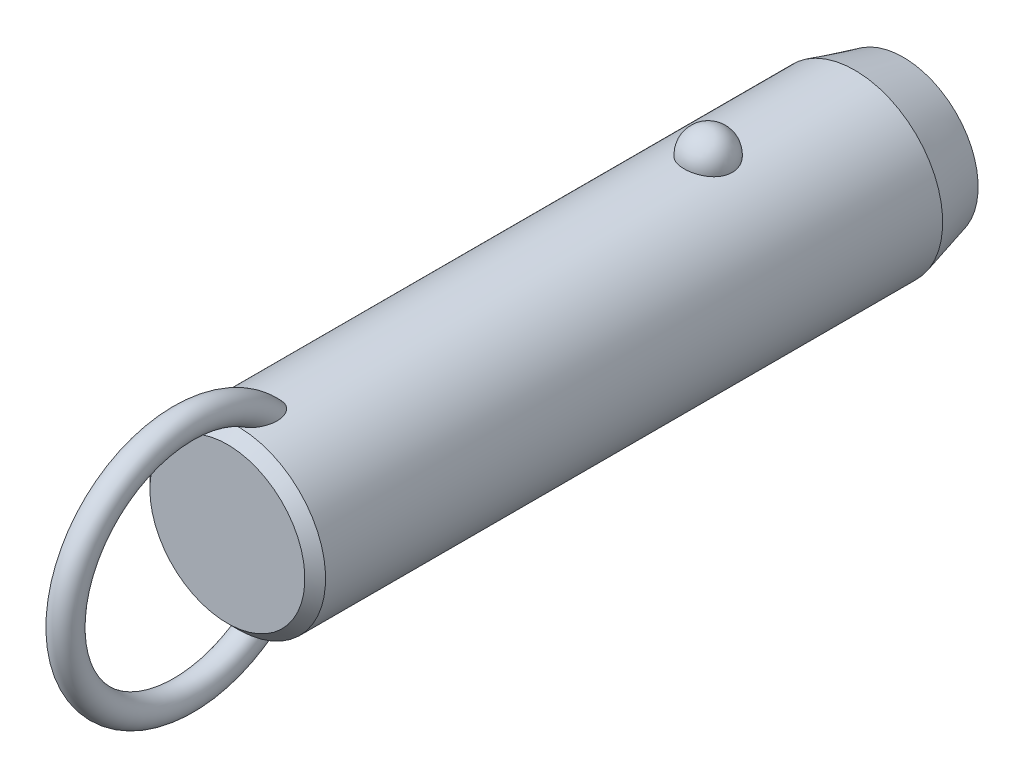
ISO-10303-21;
HEADER;
FILE_DESCRIPTION(('STEP AP214'),'2;1');
FILE_NAME('part.step','',(''),(''),'','','');
FILE_SCHEMA(('AUTOMOTIVE_DESIGN { 1 0 10303 214 1 1 1 1 }'));
ENDSEC;
DATA;
#1=APPLICATION_CONTEXT('core data for automotive mechanical design processes');
#2=APPLICATION_PROTOCOL_DEFINITION('international standard','automotive_design',2000,#1);
#3=PRODUCT_CONTEXT('',#1,'mechanical');
#4=PRODUCT('Part','Part','',(#3));
#5=PRODUCT_RELATED_PRODUCT_CATEGORY('part','',(#4));
#6=PRODUCT_DEFINITION_FORMATION('','',#4);
#7=PRODUCT_DEFINITION_CONTEXT('part definition',#1,'design');
#8=PRODUCT_DEFINITION('design','',#6,#7);
#9=PRODUCT_DEFINITION_SHAPE('','',#8);
#10=(LENGTH_UNIT() NAMED_UNIT(*) SI_UNIT(.MILLI.,.METRE.));
#11=(NAMED_UNIT(*) PLANE_ANGLE_UNIT() SI_UNIT($,.RADIAN.));
#12=(NAMED_UNIT(*) SI_UNIT($,.STERADIAN.) SOLID_ANGLE_UNIT());
#13=UNCERTAINTY_MEASURE_WITH_UNIT(LENGTH_MEASURE(1.E-05),#10,'distance_accuracy_value','');
#14=(GEOMETRIC_REPRESENTATION_CONTEXT(3) GLOBAL_UNCERTAINTY_ASSIGNED_CONTEXT((#13)) GLOBAL_UNIT_ASSIGNED_CONTEXT((#10,
#11,#12)) REPRESENTATION_CONTEXT('',''));
#15=CARTESIAN_POINT('',(0.,0.,0.));
#16=DIRECTION('',(0.,0.,1.));
#17=DIRECTION('',(1.,0.,0.));
#18=AXIS2_PLACEMENT_3D('',#15,#16,#17);
#19=CARTESIAN_POINT('',(0.,0.,53.3));
#20=DIRECTION('',(0.,0.,-1.));
#21=DIRECTION('',(-1.,0.,0.));
#22=AXIS2_PLACEMENT_3D('',#19,#20,#21);
#23=CYLINDRICAL_SURFACE('',#22,12.7);
#24=CARTESIAN_POINT('',(3.46661256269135,12.2177165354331,-3.49999999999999));
#25=CARTESIAN_POINT('',(3.4666090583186,12.2177194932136,-3.30432790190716));
#26=CARTESIAN_POINT('',(3.45063567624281,12.2222841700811,-3.10861112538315));
#27=CARTESIAN_POINT('',(3.38712451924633,12.2400345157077,-2.72271899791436));
#28=CARTESIAN_POINT('',(3.33957415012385,12.2532236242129,-2.53254588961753));
#29=CARTESIAN_POINT('',(3.2141234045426,12.286724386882,-2.16324948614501));
#30=CARTESIAN_POINT('',(3.13623639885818,12.3070329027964,-1.98412136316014));
#31=CARTESIAN_POINT('',(2.95205930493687,12.3525018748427,-1.64180592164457));
#32=CARTESIAN_POINT('',(2.84577003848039,12.3776621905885,-1.47861814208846));
#33=CARTESIAN_POINT('',(2.60688050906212,12.4301712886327,-1.17190583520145));
#34=CARTESIAN_POINT('',(2.47415697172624,12.4575299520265,-1.02847897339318));
#35=CARTESIAN_POINT('',(2.18615174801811,12.5112810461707,-0.766177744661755));
#36=CARTESIAN_POINT('',(2.03087002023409,12.5376734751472,-0.647303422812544));
#37=CARTESIAN_POINT('',(1.70237334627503,12.5864761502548,-0.437732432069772));
#38=CARTESIAN_POINT('',(1.52920948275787,12.6088972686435,-0.346958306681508));
#39=CARTESIAN_POINT('',(1.16944170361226,12.6473352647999,-0.195750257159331));
#40=CARTESIAN_POINT('',(0.982839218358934,12.663352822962,-0.135313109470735));
#41=CARTESIAN_POINT('',(0.604961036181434,12.6869706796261,-0.0473241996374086));
#42=CARTESIAN_POINT('',(0.41382314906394,12.6947125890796,-0.0192185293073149));
#43=CARTESIAN_POINT('',(0.0293827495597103,12.7014203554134,0.00517254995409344));
#44=CARTESIAN_POINT('',(-0.163919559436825,12.7003870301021,0.00146092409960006));
#45=CARTESIAN_POINT('',(-0.544374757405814,12.689735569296,-0.0373939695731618));
#46=CARTESIAN_POINT('',(-0.731575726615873,12.6802364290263,-0.0721015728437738));
#47=CARTESIAN_POINT('',(-1.09733277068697,12.6538333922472,-0.171364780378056));
#48=CARTESIAN_POINT('',(-1.27588869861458,12.6369293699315,-0.235920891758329));
#49=CARTESIAN_POINT('',(-1.6204698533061,12.5973946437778,-0.393548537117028));
#50=CARTESIAN_POINT('',(-1.78641865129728,12.5747321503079,-0.486778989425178));
#51=CARTESIAN_POINT('',(-2.10030671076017,12.5261316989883,-0.699110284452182));
#52=CARTESIAN_POINT('',(-2.24824419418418,12.5001934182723,-0.818213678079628));
#53=CARTESIAN_POINT('',(-2.52491489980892,12.4472906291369,-1.08157124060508));
#54=CARTESIAN_POINT('',(-2.65324222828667,12.4203160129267,-1.22624992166));
#55=CARTESIAN_POINT('',(-2.88410007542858,12.3687509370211,-1.53528325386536));
#56=CARTESIAN_POINT('',(-2.98662883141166,12.3441606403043,-1.69963924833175));
#57=CARTESIAN_POINT('',(-3.16432417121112,12.2998199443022,-2.04548497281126));
#58=CARTESIAN_POINT('',(-3.23917525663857,12.2801261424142,-2.22714424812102));
#59=CARTESIAN_POINT('',(-3.35800573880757,12.248167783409,-2.6009138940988));
#60=CARTESIAN_POINT('',(-3.4019860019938,12.2359030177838,-2.79302397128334));
#61=CARTESIAN_POINT('',(-3.45784812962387,12.2202347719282,-3.18140279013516));
#62=CARTESIAN_POINT('',(-3.46986123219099,12.2167950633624,-3.37765118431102));
#63=CARTESIAN_POINT('',(-3.46186273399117,12.2190638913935,-3.76943689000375));
#64=CARTESIAN_POINT('',(-3.44185196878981,12.2247721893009,-3.96497421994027));
#65=CARTESIAN_POINT('',(-3.37048652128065,12.2446381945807,-4.34881728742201));
#66=CARTESIAN_POINT('',(-3.31928253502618,12.2587552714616,-4.53715319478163));
#67=CARTESIAN_POINT('',(-3.18693461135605,12.2938237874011,-4.90231727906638));
#68=CARTESIAN_POINT('',(-3.1057895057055,12.3147754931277,-5.07914500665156));
#69=CARTESIAN_POINT('',(-2.91506431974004,12.3613125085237,-5.4173205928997));
#70=CARTESIAN_POINT('',(-2.80533587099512,12.3869217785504,-5.57858147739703));
#71=CARTESIAN_POINT('',(-2.560414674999,12.4398525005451,-5.88013283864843));
#72=CARTESIAN_POINT('',(-2.42522099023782,12.4671740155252,-6.02042254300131));
#73=CARTESIAN_POINT('',(-2.1323357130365,12.5205965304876,-6.27662798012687));
#74=CARTESIAN_POINT('',(-1.97456596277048,12.5466928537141,-6.39245542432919));
#75=CARTESIAN_POINT('',(-1.64115839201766,12.5946384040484,-6.59583547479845));
#76=CARTESIAN_POINT('',(-1.46552179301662,12.6164879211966,-6.68339001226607));
#77=CARTESIAN_POINT('',(-1.10356050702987,12.6532533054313,-6.82682153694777));
#78=CARTESIAN_POINT('',(-0.9173913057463,12.6682500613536,-6.88306988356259));
#79=CARTESIAN_POINT('',(-0.537836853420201,12.6900288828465,-6.96386887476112));
#80=CARTESIAN_POINT('',(-0.344452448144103,12.6968119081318,-6.98842322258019));
#81=CARTESIAN_POINT('',(0.0402577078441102,12.7013667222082,-7.0049646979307));
#82=CARTESIAN_POINT('',(0.231556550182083,12.6993008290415,-6.99753844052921));
#83=CARTESIAN_POINT('',(0.610105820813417,12.6867505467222,-6.95166366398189));
#84=CARTESIAN_POINT('',(0.797356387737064,12.6762664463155,-6.91321620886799));
#85=CARTESIAN_POINT('',(1.16186657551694,12.6480587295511,-6.80658431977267));
#86=CARTESIAN_POINT('',(1.33915951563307,12.6303611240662,-6.73850666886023));
#87=CARTESIAN_POINT('',(1.67968518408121,12.5896027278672,-6.57450875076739));
#88=CARTESIAN_POINT('',(1.84291705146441,12.5665416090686,-6.47858678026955));
#89=CARTESIAN_POINT('',(2.15340192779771,12.5171072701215,-6.25982455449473));
#90=CARTESIAN_POINT('',(2.30037831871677,12.4906895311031,-6.13660186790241));
#91=CARTESIAN_POINT('',(2.5717412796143,12.4376567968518,-5.86739587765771));
#92=CARTESIAN_POINT('',(2.69612388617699,12.4110417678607,-5.72140858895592));
#93=CARTESIAN_POINT('',(2.92107785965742,12.360051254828,-5.40794137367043));
#94=CARTESIAN_POINT('',(3.02121329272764,12.3357209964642,-5.24014110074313));
#95=CARTESIAN_POINT('',(3.19236291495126,12.2925446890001,-4.8896986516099));
#96=CARTESIAN_POINT('',(3.26338839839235,12.2736965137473,-4.70706226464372));
#97=CARTESIAN_POINT('',(3.36788038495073,12.245404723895,-4.35469510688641));
#98=CARTESIAN_POINT('',(3.40484026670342,12.2351018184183,-4.18605935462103));
#99=CARTESIAN_POINT('',(3.45420764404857,12.2212564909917,-3.84496058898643));
#100=CARTESIAN_POINT('',(3.46661565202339,12.2177139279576,-3.67249765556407));
#101=CARTESIAN_POINT('',(3.46661256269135,12.2177165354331,-3.49999999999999));
#102=B_SPLINE_CURVE_WITH_KNOTS('',3,(#24,#25,#26,#27,#28,#29,#30,#31,#32,#33,#34,#35,#36,#37,
#38,#39,#40,#41,#42,#43,#44,#45,#46,#47,#48,#49,#50,#51,#52,#53,#54,#55,#56,#57,#58,#59,#60,#61,
#62,#63,#64,#65,#66,#67,#68,#69,#70,#71,#72,#73,#74,#75,#76,#77,#78,#79,#80,#81,#82,#83,#84,#85,
#86,#87,#88,#89,#90,#91,#92,#93,#94,#95,#96,#97,#98,#99,#100,#101),.UNSPECIFIED.,.T.,.F.,(4,2,2,
2,2,2,2,2,2,2,2,2,2,2,2,2,2,2,2,2,2,2,2,2,2,2,2,2,2,2,2,2,2,2,2,2,2,2,4),(0.,0.586396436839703,
1.17302689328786,1.7593990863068,2.34575431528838,2.93491084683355,3.52406845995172,
4.11158733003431,4.69904375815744,5.2762784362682,5.85345931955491,6.42265312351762,
6.99185659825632,7.56427334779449,8.136746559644,8.71981013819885,9.3029135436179,
9.89247258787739,10.4820150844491,11.0691335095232,11.6562366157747,12.2405256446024,
12.8248374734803,13.412244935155,13.9996740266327,14.5891883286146,15.1786623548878,
15.7609861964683,16.3432419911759,16.9148635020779,17.4864654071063,18.0560241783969,
18.6256177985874,19.2037609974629,19.7820055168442,20.3699810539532,20.957728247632,
21.4746855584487,21.9916320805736),.UNSPECIFIED.);
#103=CARTESIAN_POINT('',(3.46661256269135,12.2177165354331,-3.49999999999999));
#104=VERTEX_POINT('',#103);
#105=EDGE_CURVE('E41',#104,#104,#102,.T.);
#106=ORIENTED_EDGE('',*,*,#105,.T.);
#107=EDGE_LOOP('',(#106));
#108=FACE_BOUND('',#107,.T.);
#109=CARTESIAN_POINT('',(0.,0.,64.5));
#110=DIRECTION('',(0.,0.,1.));
#111=DIRECTION('',(1.,0.,0.));
#112=AXIS2_PLACEMENT_3D('',#109,#110,#111);
#113=CIRCLE('',#112,12.7);
#114=CARTESIAN_POINT('',(-12.7,0.,64.5));
#115=VERTEX_POINT('',#114);
#116=EDGE_CURVE('E10',#115,#115,#113,.F.);
#117=ORIENTED_EDGE('',*,*,#116,.T.);
#118=EDGE_LOOP('',(#117));
#119=FACE_BOUND('',#118,.T.);
#120=CARTESIAN_POINT('',(-0.54812224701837,-12.6881662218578,58.2432187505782));
#121=CARTESIAN_POINT('',(-0.648865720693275,-12.6838128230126,58.277926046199));
#122=CARTESIAN_POINT('',(-0.746398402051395,-12.6783867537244,58.3220428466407));
#123=CARTESIAN_POINT('',(-0.932125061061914,-12.666091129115,58.4267647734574));
#124=CARTESIAN_POINT('',(-1.02030388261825,-12.6592192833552,58.487396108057));
#125=CARTESIAN_POINT('',(-1.18487740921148,-12.6448747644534,58.621847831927));
#126=CARTESIAN_POINT('',(-1.26134296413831,-12.637406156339,58.6955825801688));
#127=CARTESIAN_POINT('',(-1.4023120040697,-12.6225412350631,58.8536045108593));
#128=CARTESIAN_POINT('',(-1.46681470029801,-12.6151449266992,58.9378923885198));
#129=CARTESIAN_POINT('',(-1.60714786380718,-12.5981718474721,59.1496577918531));
#130=CARTESIAN_POINT('',(-1.67725126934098,-12.588900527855,59.2809624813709));
#131=CARTESIAN_POINT('',(-1.79536591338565,-12.5725964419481,59.5532471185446));
#132=CARTESIAN_POINT('',(-1.84333535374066,-12.5655679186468,59.6942447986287));
#133=CARTESIAN_POINT('',(-1.93422576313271,-12.5519624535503,60.0376455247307));
#134=CARTESIAN_POINT('',(-1.96788773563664,-12.5466298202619,60.2425578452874));
#135=CARTESIAN_POINT('',(-1.9941399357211,-12.542463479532,60.5517600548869));
#136=CARTESIAN_POINT('',(-1.99883864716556,-12.5417153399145,60.6552987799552));
#137=CARTESIAN_POINT('',(-2.00078003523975,-12.5414074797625,60.8624512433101));
#138=CARTESIAN_POINT('',(-1.99802449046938,-12.5418474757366,60.9660649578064));
#139=CARTESIAN_POINT('',(-1.98336733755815,-12.5441750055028,61.2103207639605));
#140=CARTESIAN_POINT('',(-1.96851430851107,-12.5465291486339,61.350780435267));
#141=CARTESIAN_POINT('',(-1.92707089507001,-12.5529612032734,61.629960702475));
#142=CARTESIAN_POINT('',(-1.900474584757,-12.5570399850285,61.7686803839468));
#143=CARTESIAN_POINT('',(-1.83619120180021,-12.5666008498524,62.0434113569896));
#144=CARTESIAN_POINT('',(-1.79850828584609,-12.57208240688,62.1794236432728));
#145=CARTESIAN_POINT('',(-1.71223796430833,-12.5841228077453,62.4478421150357));
#146=CARTESIAN_POINT('',(-1.6636567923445,-12.5906810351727,62.5802503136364));
#147=CARTESIAN_POINT('',(-1.57804503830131,-12.6016176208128,62.7854887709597));
#148=CARTESIAN_POINT('',(-1.54477252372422,-12.6057501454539,62.8599149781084));
#149=CARTESIAN_POINT('',(-1.47424480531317,-12.6141930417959,63.0068393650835));
#150=CARTESIAN_POINT('',(-1.43699041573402,-12.6185033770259,63.0793379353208));
#151=CARTESIAN_POINT('',(-1.35825795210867,-12.6272207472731,63.2218926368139));
#152=CARTESIAN_POINT('',(-1.31678520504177,-12.6316276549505,63.2919517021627));
#153=CARTESIAN_POINT('',(-1.22917793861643,-12.6404532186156,63.4290705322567));
#154=CARTESIAN_POINT('',(-1.18304514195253,-12.6448718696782,63.4961313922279));
#155=CARTESIAN_POINT('',(-1.0724641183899,-12.6547893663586,63.6438741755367));
#156=CARTESIAN_POINT('',(-1.00642239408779,-12.6602600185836,63.7233844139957));
#157=CARTESIAN_POINT('',(-0.864441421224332,-12.6707460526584,63.8731698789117));
#158=CARTESIAN_POINT('',(-0.788516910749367,-12.6757620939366,63.9434585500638));
#159=CARTESIAN_POINT('',(-0.652215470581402,-12.6833591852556,64.0486801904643));
#160=CARTESIAN_POINT('',(-0.594982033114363,-12.6861973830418,64.0876241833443));
#161=CARTESIAN_POINT('',(-0.475269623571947,-12.6912445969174,64.1564899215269));
#162=CARTESIAN_POINT('',(-0.412800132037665,-12.6934547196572,64.1864275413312));
#163=CARTESIAN_POINT('',(-0.295749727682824,-12.6966636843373,64.2297565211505));
#164=CARTESIAN_POINT('',(-0.241949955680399,-12.6978134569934,64.2452188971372));
#165=CARTESIAN_POINT('',(-0.132508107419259,-12.6994261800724,64.2668845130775));
#166=CARTESIAN_POINT('',(-0.0768679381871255,-12.6998898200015,64.2730970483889));
#167=CARTESIAN_POINT('',(0.0347696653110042,-12.7000752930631,64.2755838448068));
#168=CARTESIAN_POINT('',(0.0907676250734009,-12.6997954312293,64.2718353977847));
#169=CARTESIAN_POINT('',(0.201283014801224,-12.6985255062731,64.2547883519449));
#170=CARTESIAN_POINT('',(0.255799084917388,-12.6975348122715,64.2414812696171));
#171=CARTESIAN_POINT('',(0.376042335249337,-12.6946091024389,64.2020379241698));
#172=CARTESIAN_POINT('',(0.440950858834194,-12.6924943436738,64.1734492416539));
#173=CARTESIAN_POINT('',(0.565350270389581,-12.6875639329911,64.1063234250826));
#174=CARTESIAN_POINT('',(0.624828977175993,-12.6847467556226,64.0677646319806));
#175=CARTESIAN_POINT('',(0.774116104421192,-12.6767252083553,63.956949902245));
#176=CARTESIAN_POINT('',(0.859449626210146,-12.6711344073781,63.8787605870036));
#177=CARTESIAN_POINT('',(1.01789440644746,-12.6593922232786,63.710943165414));
#178=CARTESIAN_POINT('',(1.09096902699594,-12.653239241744,63.621282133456));
#179=CARTESIAN_POINT('',(1.22268793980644,-12.6411674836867,63.440265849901));
#180=CARTESIAN_POINT('',(1.28193986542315,-12.6352572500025,63.349345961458));
#181=CARTESIAN_POINT('',(1.39259777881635,-12.6235401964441,63.1627929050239));
#182=CARTESIAN_POINT('',(1.44399707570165,-12.6177334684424,63.0671558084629));
#183=CARTESIAN_POINT('',(1.53972870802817,-12.6064093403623,62.8722738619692));
#184=CARTESIAN_POINT('',(1.58405262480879,-12.6008922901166,62.7730248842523));
#185=CARTESIAN_POINT('',(1.66600705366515,-12.5903187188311,62.5717727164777));
#186=CARTESIAN_POINT('',(1.70363651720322,-12.5852622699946,62.4697690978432));
#187=CARTESIAN_POINT('',(1.7754537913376,-12.5753406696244,62.2543580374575));
#188=CARTESIAN_POINT('',(1.80903453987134,-12.5705328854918,62.1407454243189));
#189=CARTESIAN_POINT('',(1.86844163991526,-12.5618400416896,61.9114575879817));
#190=CARTESIAN_POINT('',(1.89426665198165,-12.5579551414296,61.7957820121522));
#191=CARTESIAN_POINT('',(1.93785464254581,-12.5513030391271,61.5630072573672));
#192=CARTESIAN_POINT('',(1.95562640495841,-12.5485346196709,61.4459097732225));
#193=CARTESIAN_POINT('',(1.98264463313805,-12.5442934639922,61.2107473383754));
#194=CARTESIAN_POINT('',(1.99189298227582,-12.5428204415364,61.0926826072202));
#195=CARTESIAN_POINT('',(2.00416068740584,-12.540871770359,60.7806225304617));
#196=CARTESIAN_POINT('',(1.99944433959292,-12.541631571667,60.586229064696));
#197=CARTESIAN_POINT('',(1.9611375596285,-12.5476846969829,60.2003095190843));
#198=CARTESIAN_POINT('',(1.92758341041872,-12.5529723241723,60.0087801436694));
#199=CARTESIAN_POINT('',(1.83934342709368,-12.5661532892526,59.6822728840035));
#200=CARTESIAN_POINT('',(1.79215440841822,-12.5730485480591,59.5452499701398));
#201=CARTESIAN_POINT('',(1.67676242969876,-12.588958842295,59.2804459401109));
#202=CARTESIAN_POINT('',(1.60859050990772,-12.597970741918,59.1526515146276));
#203=CARTESIAN_POINT('',(1.46583832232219,-12.6152829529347,58.9358006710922));
#204=CARTESIAN_POINT('',(1.39525727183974,-12.6233659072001,58.8441050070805));
#205=CARTESIAN_POINT('',(1.23992594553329,-12.6395676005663,58.6734854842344));
#206=CARTESIAN_POINT('',(1.15517932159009,-12.6476863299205,58.5945583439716));
#207=CARTESIAN_POINT('',(0.971995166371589,-12.6630846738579,58.4526438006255));
#208=CARTESIAN_POINT('',(0.873456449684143,-12.6703572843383,58.389784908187));
#209=CARTESIAN_POINT('',(0.66584770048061,-12.6829569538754,58.2844870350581));
#210=CARTESIAN_POINT('',(0.556784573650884,-12.688285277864,58.2420347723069));
#211=CARTESIAN_POINT('',(0.347338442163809,-12.6956226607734,58.1844434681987));
#212=CARTESIAN_POINT('',(0.247759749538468,-12.6979816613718,58.1663996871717));
#213=CARTESIAN_POINT('',(0.0470218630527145,-12.7003077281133,58.1486007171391));
#214=CARTESIAN_POINT('',(-0.0541350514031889,-12.7002779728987,58.1488212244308));
#215=CARTESIAN_POINT('',(-0.221414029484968,-12.6982482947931,58.1643639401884));
#216=CARTESIAN_POINT('',(-0.288055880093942,-12.6969033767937,58.1746662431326));
#217=CARTESIAN_POINT('',(-0.419599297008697,-12.6932369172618,58.2031348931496));
#218=CARTESIAN_POINT('',(-0.484501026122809,-12.6909154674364,58.2213005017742));
#219=CARTESIAN_POINT('',(-0.54812224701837,-12.6881662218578,58.2432187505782));
#220=B_SPLINE_CURVE_WITH_KNOTS('',3,(#120,#121,#122,#123,#124,#125,#126,#127,#128,#129,#130,
#131,#132,#133,#134,#135,#136,#137,#138,#139,#140,#141,#142,#143,#144,#145,#146,#147,#148,#149,
#150,#151,#152,#153,#154,#155,#156,#157,#158,#159,#160,#161,#162,#163,#164,#165,#166,#167,#168,
#169,#170,#171,#172,#173,#174,#175,#176,#177,#178,#179,#180,#181,#182,#183,#184,#185,#186,#187,
#188,#189,#190,#191,#192,#193,#194,#195,#196,#197,#198,#199,#200,#201,#202,#203,#204,#205,#206,
#207,#208,#209,#210,#211,#212,#213,#214,#215,#216,#217,#218,#219),.UNSPECIFIED.,.T.,.F.,(4,2,2,
2,2,2,2,2,2,2,2,2,2,2,2,2,2,2,2,2,2,2,2,2,2,2,2,2,2,2,2,2,2,2,2,2,2,2,2,2,2,2,2,2,2,2,2,2,2,4),
(0.,0.319642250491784,0.639794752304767,0.957927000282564,1.27608021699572,1.72100165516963,
2.16675988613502,2.78630021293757,3.09705782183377,3.40774128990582,3.83096358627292,
4.25439969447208,4.67767724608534,5.1007133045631,5.34550297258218,5.59024267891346,
5.83467707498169,6.07902143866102,6.38891080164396,6.69834321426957,6.90560910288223,
7.11250749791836,7.27977315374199,7.44687060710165,7.6143493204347,7.78197685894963,
7.99365544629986,8.20579780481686,8.55147335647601,8.89816429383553,9.22375138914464,
9.54961437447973,9.87586224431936,10.202161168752,10.5575872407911,10.9130746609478,
11.2681734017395,11.6231936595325,12.2046601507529,12.7853961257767,13.219164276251,
13.6522938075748,13.9989174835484,14.3454519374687,14.6946768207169,15.0436740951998,
15.3457513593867,15.6474266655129,15.8493051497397,16.0511646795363),.UNSPECIFIED.);
#221=CARTESIAN_POINT('',(-0.54812224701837,-12.6881662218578,58.2432187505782));
#222=VERTEX_POINT('',#221);
#223=EDGE_CURVE('E60',#222,#222,#220,.T.);
#224=ORIENTED_EDGE('',*,*,#223,.T.);
#225=EDGE_LOOP('',(#224));
#226=FACE_BOUND('',#225,.T.);
#227=CARTESIAN_POINT('',(-0.54812224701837,12.6881662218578,58.2432187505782));
#228=CARTESIAN_POINT('',(-0.459436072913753,12.6919968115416,58.212673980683));
#229=CARTESIAN_POINT('',(-0.368189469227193,12.6949996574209,58.1893913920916));
#230=CARTESIAN_POINT('',(-0.183024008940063,12.6990186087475,58.1584062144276));
#231=CARTESIAN_POINT('',(-0.089104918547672,12.7000345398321,58.1507049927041));
#232=CARTESIAN_POINT('',(0.098714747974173,12.6999636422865,58.1512455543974));
#233=CARTESIAN_POINT('',(0.192615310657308,12.6988761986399,58.1594920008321));
#234=CARTESIAN_POINT('',(0.377658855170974,12.6947211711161,58.1915515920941));
#235=CARTESIAN_POINT('',(0.468801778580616,12.6916535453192,58.2153650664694));
#236=CARTESIAN_POINT('',(0.645809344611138,12.6838788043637,58.2774565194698));
#237=CARTESIAN_POINT('',(0.731679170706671,12.6791733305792,58.315720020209));
#238=CARTESIAN_POINT('',(0.896315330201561,12.6686004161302,58.405120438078));
#239=CARTESIAN_POINT('',(0.975080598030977,12.6627328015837,58.4562592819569));
#240=CARTESIAN_POINT('',(1.12963655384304,12.6499161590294,58.5736782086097));
#241=CARTESIAN_POINT('',(1.20478673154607,12.6429194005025,58.6407929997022));
#242=CARTESIAN_POINT('',(1.34448241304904,12.6288282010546,58.7852250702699));
#243=CARTESIAN_POINT('',(1.40902173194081,12.621733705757,58.8625482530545));
#244=CARTESIAN_POINT('',(1.55208211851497,12.6050877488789,59.0592475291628));
#245=CARTESIAN_POINT('',(1.62510490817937,12.5957546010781,59.1826540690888));
#246=CARTESIAN_POINT('',(1.7501904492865,12.5789823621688,59.4397690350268));
#247=CARTESIAN_POINT('',(1.80221377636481,12.5715468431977,59.573496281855));
#248=CARTESIAN_POINT('',(1.90309965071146,12.5567434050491,59.8983516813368));
#249=CARTESIAN_POINT('',(1.94342317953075,12.5504515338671,60.0921611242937));
#250=CARTESIAN_POINT('',(1.99332997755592,12.5426147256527,60.4837881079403));
#251=CARTESIAN_POINT('',(2.00285305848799,12.5410790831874,60.6816127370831));
#252=CARTESIAN_POINT('',(1.99678999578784,12.5420407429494,61.0166427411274));
#253=CARTESIAN_POINT('',(1.98794117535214,12.5434564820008,61.1540428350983));
#254=CARTESIAN_POINT('',(1.95865119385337,12.5480641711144,61.4276394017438));
#255=CARTESIAN_POINT('',(1.9382043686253,12.5512569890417,61.5638352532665));
#256=CARTESIAN_POINT('',(1.88647896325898,12.5591352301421,61.8342493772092));
#257=CARTESIAN_POINT('',(1.85518800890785,12.5638223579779,61.9684652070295));
#258=CARTESIAN_POINT('',(1.78217886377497,12.5743868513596,62.2339362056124));
#259=CARTESIAN_POINT('',(1.74046509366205,12.5802637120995,62.3651926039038));
#260=CARTESIAN_POINT('',(1.66024095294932,12.5910571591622,62.5860855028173));
#261=CARTESIAN_POINT('',(1.62434772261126,12.5957535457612,62.6766904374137));
#262=CARTESIAN_POINT('',(1.5470900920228,12.6054762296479,62.8555125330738));
#263=CARTESIAN_POINT('',(1.50572681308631,12.6105024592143,62.9437301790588));
#264=CARTESIAN_POINT('',(1.41728020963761,12.620748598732,63.1169321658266));
#265=CARTESIAN_POINT('',(1.37021377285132,12.625967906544,63.2019251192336));
#266=CARTESIAN_POINT('',(1.2696962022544,12.6364721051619,63.3680072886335));
#267=CARTESIAN_POINT('',(1.21624929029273,12.6417569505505,63.4490990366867));
#268=CARTESIAN_POINT('',(1.10304413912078,12.6521331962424,63.6047027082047));
#269=CARTESIAN_POINT('',(1.04340936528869,12.657226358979,63.6793033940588));
#270=CARTESIAN_POINT('',(0.915919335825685,12.6670906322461,63.821324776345));
#271=CARTESIAN_POINT('',(0.848064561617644,12.6718617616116,63.8887458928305));
#272=CARTESIAN_POINT('',(0.717035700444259,12.67987711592,64.0006247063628));
#273=CARTESIAN_POINT('',(0.655526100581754,12.6832377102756,64.0469970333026));
#274=CARTESIAN_POINT('',(0.525985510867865,12.6892676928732,64.1296195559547));
#275=CARTESIAN_POINT('',(0.457969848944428,12.6919386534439,64.1658927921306));
#276=CARTESIAN_POINT('',(0.334859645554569,12.695691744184,64.2166572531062));
#277=CARTESIAN_POINT('',(0.281116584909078,12.6970073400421,64.2343733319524));
#278=CARTESIAN_POINT('',(0.171425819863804,12.6989609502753,64.2606429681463));
#279=CARTESIAN_POINT('',(0.115480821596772,12.699599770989,64.2692074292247));
#280=CARTESIAN_POINT('',(0.00272618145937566,12.7001251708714,64.2762531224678));
#281=CARTESIAN_POINT('',(-0.0540859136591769,12.7000089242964,64.2746964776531));
#282=CARTESIAN_POINT('',(-0.166544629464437,12.6990328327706,64.2616005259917));
#283=CARTESIAN_POINT('',(-0.222190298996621,12.6981724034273,64.2500533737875));
#284=CARTESIAN_POINT('',(-0.342018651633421,12.695562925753,64.2149128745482));
#285=CARTESIAN_POINT('',(-0.405606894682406,12.6936676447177,64.1893322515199));
#286=CARTESIAN_POINT('',(-0.527815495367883,12.6891754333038,64.1283111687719));
#287=CARTESIAN_POINT('',(-0.586425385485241,12.6865770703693,64.0928505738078));
#288=CARTESIAN_POINT('',(-0.731842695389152,12.6792129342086,63.9914960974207));
#289=CARTESIAN_POINT('',(-0.814709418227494,12.6740767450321,63.9200395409));
#290=CARTESIAN_POINT('',(-0.969101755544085,12.6632083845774,63.7658900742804));
#291=CARTESIAN_POINT('',(-1.04059564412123,12.6574746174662,63.6831668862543));
#292=CARTESIAN_POINT('',(-1.16981116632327,12.6461638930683,63.5158096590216));
#293=CARTESIAN_POINT('',(-1.22811369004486,12.6405994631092,63.4316166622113));
#294=CARTESIAN_POINT('',(-1.33743405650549,12.6295007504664,63.2585791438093));
#295=CARTESIAN_POINT('',(-1.38844577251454,12.6239664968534,63.1697307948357));
#296=CARTESIAN_POINT('',(-1.48400702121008,12.6130898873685,62.988389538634));
#297=CARTESIAN_POINT('',(-1.52854232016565,12.6077479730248,62.8958891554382));
#298=CARTESIAN_POINT('',(-1.61150113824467,12.5974127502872,62.7081607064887));
#299=CARTESIAN_POINT('',(-1.64992317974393,12.5924195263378,62.6129319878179));
#300=CARTESIAN_POINT('',(-1.7346858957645,12.581070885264,62.3828936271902));
#301=CARTESIAN_POINT('',(-1.77831261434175,12.5749388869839,62.2470661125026));
#302=CARTESIAN_POINT('',(-1.85439734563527,12.5639437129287,61.9722128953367));
#303=CARTESIAN_POINT('',(-1.88684994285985,12.5590811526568,61.8331856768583));
#304=CARTESIAN_POINT('',(-1.94008483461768,12.550968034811,61.5530923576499));
#305=CARTESIAN_POINT('',(-1.96088706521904,12.5477147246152,61.4120301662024));
#306=CARTESIAN_POINT('',(-1.99000539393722,12.5431291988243,61.1286689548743));
#307=CARTESIAN_POINT('',(-1.99832911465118,12.5417958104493,60.9863707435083));
#308=CARTESIAN_POINT('',(-2.00166624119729,12.5412674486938,60.6576271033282));
#309=CARTESIAN_POINT('',(-1.99178843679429,12.5428579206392,60.4710880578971));
#310=CARTESIAN_POINT('',(-1.94455183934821,12.5502731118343,60.1016240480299));
#311=CARTESIAN_POINT('',(-1.9072403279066,12.5560905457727,59.9186934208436));
#312=CARTESIAN_POINT('',(-1.81330718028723,12.5699462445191,59.6048488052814));
#313=CARTESIAN_POINT('',(-1.76338820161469,12.5771273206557,59.4719105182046));
#314=CARTESIAN_POINT('',(-1.64305018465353,12.593414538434,59.2156813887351));
#315=CARTESIAN_POINT('',(-1.57265346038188,12.6025185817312,59.092380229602));
#316=CARTESIAN_POINT('',(-1.4263495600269,12.6198178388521,58.8835648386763));
#317=CARTESIAN_POINT('',(-1.35423772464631,12.6278405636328,58.7953846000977));
#318=CARTESIAN_POINT('',(-1.19645664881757,12.6437632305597,58.632107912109));
#319=CARTESIAN_POINT('',(-1.1108053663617,12.6516633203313,58.5569944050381));
#320=CARTESIAN_POINT('',(-0.947219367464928,12.6648319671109,58.4378114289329));
#321=CARTESIAN_POINT('',(-0.871624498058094,12.670300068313,58.3905414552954));
#322=CARTESIAN_POINT('',(-0.714161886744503,12.6801492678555,58.3077413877));
#323=CARTESIAN_POINT('',(-0.632295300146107,12.684530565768,58.2722091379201));
#324=CARTESIAN_POINT('',(-0.54812224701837,12.6881662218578,58.2432187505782));
#325=B_SPLINE_CURVE_WITH_KNOTS('',3,(#227,#228,#229,#230,#231,#232,#233,#234,#235,#236,#237,
#238,#239,#240,#241,#242,#243,#244,#245,#246,#247,#248,#249,#250,#251,#252,#253,#254,#255,#256,
#257,#258,#259,#260,#261,#262,#263,#264,#265,#266,#267,#268,#269,#270,#271,#272,#273,#274,#275,
#276,#277,#278,#279,#280,#281,#282,#283,#284,#285,#286,#287,#288,#289,#290,#291,#292,#293,#294,
#295,#296,#297,#298,#299,#300,#301,#302,#303,#304,#305,#306,#307,#308,#309,#310,#311,#312,#313,
#314,#315,#316,#317,#318,#319,#320,#321,#322,#323,#324),.UNSPECIFIED.,.T.,.F.,(4,2,2,2,2,2,2,2,
2,2,2,2,2,2,2,2,2,2,2,2,2,2,2,2,2,2,2,2,2,2,2,2,2,2,2,2,2,2,2,2,2,2,2,2,2,2,2,2,4),(0.,
0.281328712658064,0.562682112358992,0.844117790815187,1.12555942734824,1.40671982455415,
1.68792232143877,1.98972294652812,2.2916988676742,2.72039860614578,3.14989948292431,
3.7408491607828,4.33295293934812,4.74554109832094,5.15833092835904,5.57159335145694,
5.98468079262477,6.27722775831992,6.56971484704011,6.86135609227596,7.15280542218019,
7.43927407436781,7.72572595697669,7.95635862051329,8.18646071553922,8.35559393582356,
8.52452541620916,8.6940894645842,8.86378678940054,9.06834348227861,9.2733201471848,
9.60010414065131,9.92778432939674,10.2350252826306,10.5425229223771,10.8506864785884,
11.15892440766,11.5867893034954,12.0148612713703,12.4421984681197,12.8692745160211,
13.4279365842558,13.9856380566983,14.4107062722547,14.8353130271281,15.1765567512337,
15.517351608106,15.7844129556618,16.051425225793),.UNSPECIFIED.);
#326=CARTESIAN_POINT('',(-0.54812224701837,12.6881662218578,58.2432187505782));
#327=VERTEX_POINT('',#326);
#328=EDGE_CURVE('E68',#327,#327,#325,.T.);
#329=ORIENTED_EDGE('',*,*,#328,.T.);
#330=EDGE_LOOP('',(#329));
#331=FACE_BOUND('',#330,.T.);
#332=CARTESIAN_POINT('',(0.,0.,-24.6999999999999));
#333=DIRECTION('',(0.,0.,-1.));
#334=DIRECTION('',(-1.,0.,0.));
#335=AXIS2_PLACEMENT_3D('',#332,#333,#334);
#336=CIRCLE('',#335,12.7);
#337=CARTESIAN_POINT('',(-12.7,0.,-24.6999999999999));
#338=VERTEX_POINT('',#337);
#339=EDGE_CURVE('E57',#338,#338,#336,.F.);
#340=ORIENTED_EDGE('',*,*,#339,.T.);
#341=EDGE_LOOP('',(#340));
#342=FACE_BOUND('',#341,.T.);
#343=ADVANCED_FACE('F37',(#108,#119,#226,#331,#342),#23,.T.);
#344=CARTESIAN_POINT('',(0.,0.,-31.7));
#345=DIRECTION('',(0.,0.,-1.));
#346=DIRECTION('',(-1.,0.,0.));
#347=AXIS2_PLACEMENT_3D('',#344,#345,#346);
#348=PLANE('',#347);
#349=CARTESIAN_POINT('',(0.,0.,-31.7));
#350=DIRECTION('',(0.,0.,-1.));
#351=DIRECTION('',(-1.,0.,0.));
#352=AXIS2_PLACEMENT_3D('',#349,#350,#351);
#353=CIRCLE('',#352,10.8243556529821);
#354=CARTESIAN_POINT('',(-10.8243556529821,0.,-31.7));
#355=VERTEX_POINT('',#354);
#356=EDGE_CURVE('E67',#355,#355,#353,.T.);
#357=ORIENTED_EDGE('',*,*,#356,.T.);
#358=EDGE_LOOP('',(#357));
#359=FACE_BOUND('',#358,.T.);
#360=ADVANCED_FACE('F86',(#359),#348,.T.);
#361=CARTESIAN_POINT('',(0.,0.,-31.7));
#362=DIRECTION('',(0.,0.,1.));
#363=DIRECTION('',(1.,0.,0.));
#364=AXIS2_PLACEMENT_3D('',#361,#362,#363);
#365=CONICAL_SURFACE('',#364,10.8243556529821,0.261799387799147);
#366=ORIENTED_EDGE('',*,*,#339,.F.);
#367=EDGE_LOOP('',(#366));
#368=FACE_BOUND('',#367,.T.);
#369=ORIENTED_EDGE('',*,*,#356,.F.);
#370=EDGE_LOOP('',(#369));
#371=FACE_BOUND('',#370,.T.);
#372=ADVANCED_FACE('F84',(#368,#371),#365,.T.);
#373=CARTESIAN_POINT('',(0.,0.,66.));
#374=DIRECTION('',(0.,0.,1.));
#375=DIRECTION('',(1.,0.,0.));
#376=AXIS2_PLACEMENT_3D('',#373,#374,#375);
#377=PLANE('',#376);
#378=CARTESIAN_POINT('',(0.,0.,66.));
#379=DIRECTION('',(0.,0.,1.));
#380=DIRECTION('',(1.,0.,0.));
#381=AXIS2_PLACEMENT_3D('',#378,#379,#380);
#382=CIRCLE('',#381,11.2);
#383=CARTESIAN_POINT('',(-11.2,0.,66.));
#384=VERTEX_POINT('',#383);
#385=EDGE_CURVE('E50',#384,#384,#382,.T.);
#386=ORIENTED_EDGE('',*,*,#385,.T.);
#387=EDGE_LOOP('',(#386));
#388=FACE_BOUND('',#387,.T.);
#389=ADVANCED_FACE('F78',(#388),#377,.T.);
#390=CARTESIAN_POINT('',(0.,0.,72.35));
#391=DIRECTION('',(1.,0.,0.));
#392=DIRECTION('',(0.,0.,-1.));
#393=AXIS2_PLACEMENT_3D('',#390,#391,#392);
#394=TOROIDAL_SURFACE('',#393,17.05,2.);
#395=ORIENTED_EDGE('',*,*,#328,.F.);
#396=EDGE_LOOP('',(#395));
#397=FACE_BOUND('',#396,.T.);
#398=ORIENTED_EDGE('',*,*,#223,.F.);
#399=EDGE_LOOP('',(#398));
#400=FACE_BOUND('',#399,.T.);
#401=ADVANCED_FACE('F74',(#397,#400),#394,.T.);
#402=CARTESIAN_POINT('',(0.,0.,66.));
#403=DIRECTION('',(0.,0.,-1.));
#404=DIRECTION('',(-1.,0.,0.));
#405=AXIS2_PLACEMENT_3D('',#402,#403,#404);
#406=CONICAL_SURFACE('',#405,11.2,0.785398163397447);
#407=CARTESIAN_POINT('',(-12.7,0.,64.5));
#408=CARTESIAN_POINT('',(-12.684375,0.,64.515625));
#409=CARTESIAN_POINT('',(-12.66875,0.,64.53125));
#410=CARTESIAN_POINT('',(-12.6375,0.,64.5625));
#411=CARTESIAN_POINT('',(-12.621875,0.,64.578125));
#412=CARTESIAN_POINT('',(-12.590625,0.,64.609375));
#413=CARTESIAN_POINT('',(-12.575,0.,64.625));
#414=CARTESIAN_POINT('',(-12.54375,0.,64.65625));
#415=CARTESIAN_POINT('',(-12.528125,0.,64.671875));
#416=CARTESIAN_POINT('',(-12.496875,0.,64.703125));
#417=CARTESIAN_POINT('',(-12.48125,0.,64.71875));
#418=CARTESIAN_POINT('',(-12.45,0.,64.75));
#419=CARTESIAN_POINT('',(-12.434375,0.,64.765625));
#420=CARTESIAN_POINT('',(-12.403125,0.,64.796875));
#421=CARTESIAN_POINT('',(-12.3875,0.,64.8125));
#422=CARTESIAN_POINT('',(-12.35625,0.,64.84375));
#423=CARTESIAN_POINT('',(-12.340625,0.,64.859375));
#424=CARTESIAN_POINT('',(-12.309375,0.,64.890625));
#425=CARTESIAN_POINT('',(-12.29375,0.,64.90625));
#426=CARTESIAN_POINT('',(-12.2625,0.,64.9375));
#427=CARTESIAN_POINT('',(-12.246875,0.,64.953125));
#428=CARTESIAN_POINT('',(-12.215625,0.,64.984375));
#429=CARTESIAN_POINT('',(-12.2,0.,65.));
#430=CARTESIAN_POINT('',(-12.16875,0.,65.03125));
#431=CARTESIAN_POINT('',(-12.153125,0.,65.046875));
#432=CARTESIAN_POINT('',(-12.121875,0.,65.078125));
#433=CARTESIAN_POINT('',(-12.10625,0.,65.09375));
#434=CARTESIAN_POINT('',(-12.075,0.,65.125));
#435=CARTESIAN_POINT('',(-12.059375,0.,65.140625));
#436=CARTESIAN_POINT('',(-12.028125,0.,65.171875));
#437=CARTESIAN_POINT('',(-12.0125,0.,65.1875));
#438=CARTESIAN_POINT('',(-11.98125,0.,65.21875));
#439=CARTESIAN_POINT('',(-11.965625,0.,65.234375));
#440=CARTESIAN_POINT('',(-11.934375,0.,65.265625));
#441=CARTESIAN_POINT('',(-11.91875,0.,65.28125));
#442=CARTESIAN_POINT('',(-11.8875,0.,65.3125));
#443=CARTESIAN_POINT('',(-11.871875,0.,65.328125));
#444=CARTESIAN_POINT('',(-11.840625,0.,65.359375));
#445=CARTESIAN_POINT('',(-11.825,0.,65.375));
#446=CARTESIAN_POINT('',(-11.79375,0.,65.40625));
#447=CARTESIAN_POINT('',(-11.778125,0.,65.421875));
#448=CARTESIAN_POINT('',(-11.746875,0.,65.453125));
#449=CARTESIAN_POINT('',(-11.73125,0.,65.46875));
#450=CARTESIAN_POINT('',(-11.7,0.,65.5));
#451=CARTESIAN_POINT('',(-11.684375,0.,65.515625));
#452=CARTESIAN_POINT('',(-11.653125,0.,65.546875));
#453=CARTESIAN_POINT('',(-11.6375,0.,65.5625));
#454=CARTESIAN_POINT('',(-11.60625,0.,65.59375));
#455=CARTESIAN_POINT('',(-11.590625,0.,65.609375));
#456=CARTESIAN_POINT('',(-11.559375,0.,65.640625));
#457=CARTESIAN_POINT('',(-11.54375,0.,65.65625));
#458=CARTESIAN_POINT('',(-11.5125,0.,65.6875));
#459=CARTESIAN_POINT('',(-11.496875,0.,65.703125));
#460=CARTESIAN_POINT('',(-11.465625,0.,65.734375));
#461=CARTESIAN_POINT('',(-11.45,0.,65.75));
#462=CARTESIAN_POINT('',(-11.41875,0.,65.78125));
#463=CARTESIAN_POINT('',(-11.403125,0.,65.796875));
#464=CARTESIAN_POINT('',(-11.371875,0.,65.828125));
#465=CARTESIAN_POINT('',(-11.35625,0.,65.84375));
#466=CARTESIAN_POINT('',(-11.325,0.,65.875));
#467=CARTESIAN_POINT('',(-11.309375,0.,65.890625));
#468=CARTESIAN_POINT('',(-11.278125,0.,65.921875));
#469=CARTESIAN_POINT('',(-11.2625,0.,65.9375));
#470=CARTESIAN_POINT('',(-11.23125,0.,65.96875));
#471=CARTESIAN_POINT('',(-11.215625,0.,65.984375));
#472=CARTESIAN_POINT('',(-11.2,0.,66.));
#473=B_SPLINE_CURVE_WITH_KNOTS('',3,(#407,#408,#409,#410,#411,#412,#413,#414,#415,#416,#417,
#418,#419,#420,#421,#422,#423,#424,#425,#426,#427,#428,#429,#430,#431,#432,#433,#434,#435,#436,
#437,#438,#439,#440,#441,#442,#443,#444,#445,#446,#447,#448,#449,#450,#451,#452,#453,#454,#455,
#456,#457,#458,#459,#460,#461,#462,#463,#464,#465,#466,#467,#468,#469,#470,#471,#472),
.UNSPECIFIED.,.F.,.F.,(4,2,2,2,2,2,2,2,2,2,2,2,2,2,2,2,2,2,2,2,2,2,2,2,2,2,2,2,2,2,2,2,4),(0.,
0.0662912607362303,0.132582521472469,0.198873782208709,0.265165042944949,0.33145630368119,
0.397747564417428,0.464038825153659,0.530330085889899,0.596621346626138,0.662912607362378,
0.729203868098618,0.795495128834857,0.861786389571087,0.928077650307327,0.994368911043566,
1.06066017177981,1.12695143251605,1.19324269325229,1.25953395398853,1.32582521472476,
1.39211647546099,1.45840773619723,1.52469899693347,1.59099025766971,1.65728151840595,
1.72357277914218,1.78986403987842,1.85615530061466,1.9224465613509,1.98873782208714,
2.05502908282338,2.12132034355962),.UNSPECIFIED.);
#474=EDGE_CURVE('BSEAM39',#115,#384,#473,.T.);
#475=ORIENTED_EDGE('',*,*,#116,.F.);
#476=ORIENTED_EDGE('',*,*,#385,.F.);
#477=ORIENTED_EDGE('',*,*,#474,.T.);
#478=ORIENTED_EDGE('',*,*,#474,.F.);
#479=EDGE_LOOP('',(#475,#477,#476,#478));
#480=FACE_BOUND('',#479,.T.);
#481=ADVANCED_FACE('F39',(#480),#406,.T.);
#482=CARTESIAN_POINT('',(0.,12.7,-3.49999999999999));
#483=DIRECTION('',(0.,1.,0.));
#484=DIRECTION('',(0.,0.,-1.));
#485=AXIS2_PLACEMENT_3D('',#482,#483,#484);
#486=SPHERICAL_SURFACE('',#485,3.5);
#487=ORIENTED_EDGE('',*,*,#105,.F.);
#488=EDGE_LOOP('',(#487));
#489=FACE_BOUND('',#488,.T.);
#490=ADVANCED_FACE('F80',(#489),#486,.T.);
#491=CLOSED_SHELL('',(#343,#360,#372,#389,#401,#481,#490));
#492=MANIFOLD_SOLID_BREP('B2',#491);
#493=ADVANCED_BREP_SHAPE_REPRESENTATION('',(#18,#492),#14);
#494=SHAPE_DEFINITION_REPRESENTATION(#9,#493);
ENDSEC;
END-ISO-10303-21;
